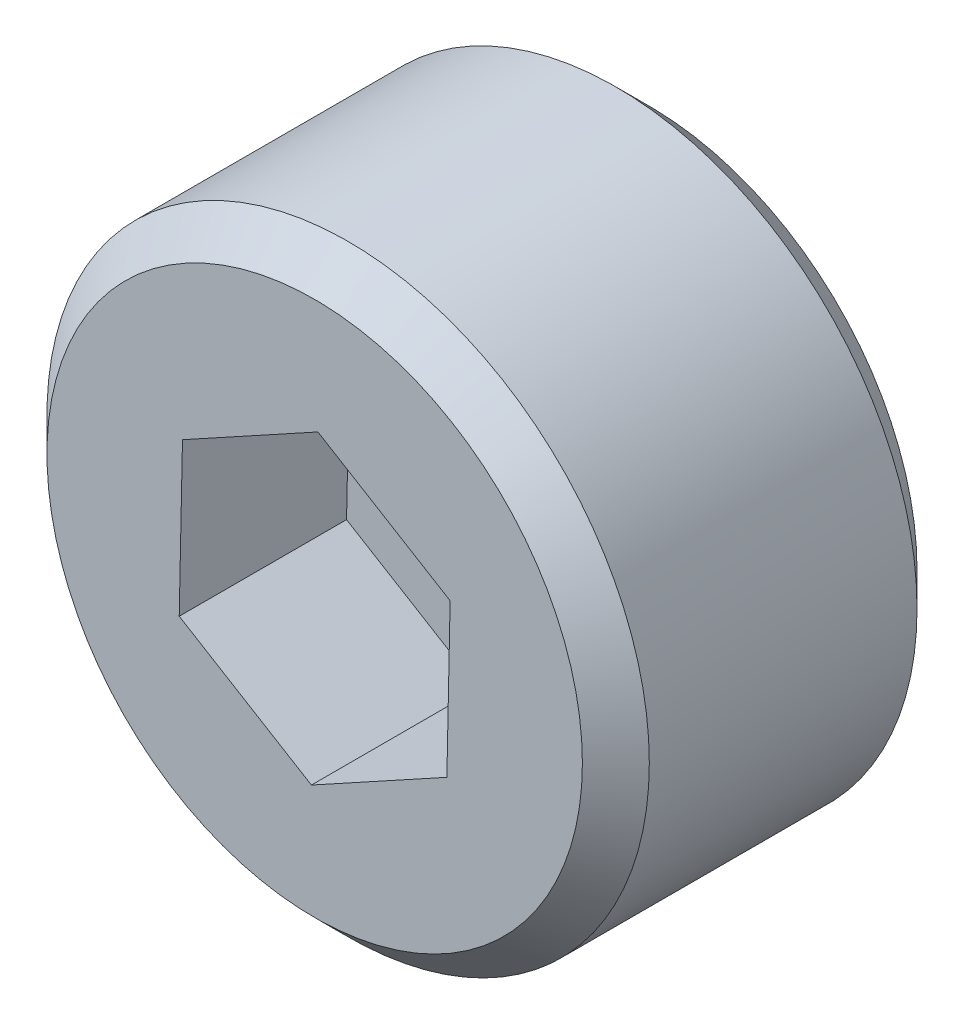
from build123d import *

# Parameters (mm, degrees)
CROQUIS1_R              = 9
SALIENTE_EXTRUIR1_DEPTH = 10
CORTAR_EXTRUIR1_DEPTH   = 5
CHAFL_N1_SIZE           = 1


with BuildPart() as part:
    # Croquis1 → Saliente-Extruir1 (new body)
    with BuildSketch(Plane.XY):
        Circle(CROQUIS1_R)
    extrude(amount=SALIENTE_EXTRUIR1_DEPTH)

    # Croquis2 → Cortar-Extruir1 (cut)
    with BuildSketch(Plane.XY.offset(10)):
        Polygon((-3.950348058, 2.393341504), (-4.047868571, -2.22443102), (-0.097520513, -4.617772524), (3.950348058, -2.393341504), (4.047868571, 2.22443102), (0.097520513, 4.617772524), align=None)
    extrude(amount=-CORTAR_EXTRUIR1_DEPTH, mode=Mode.SUBTRACT)

    # Chafl_n1
    chafl_n1_edges = [part.edges().sort_by_distance(p)[0] for p in [
        (-9, 0, 0),
        (-9, 0, 10),
    ]]
    chamfer(chafl_n1_edges, length=CHAFL_N1_SIZE)


solid = part.part
